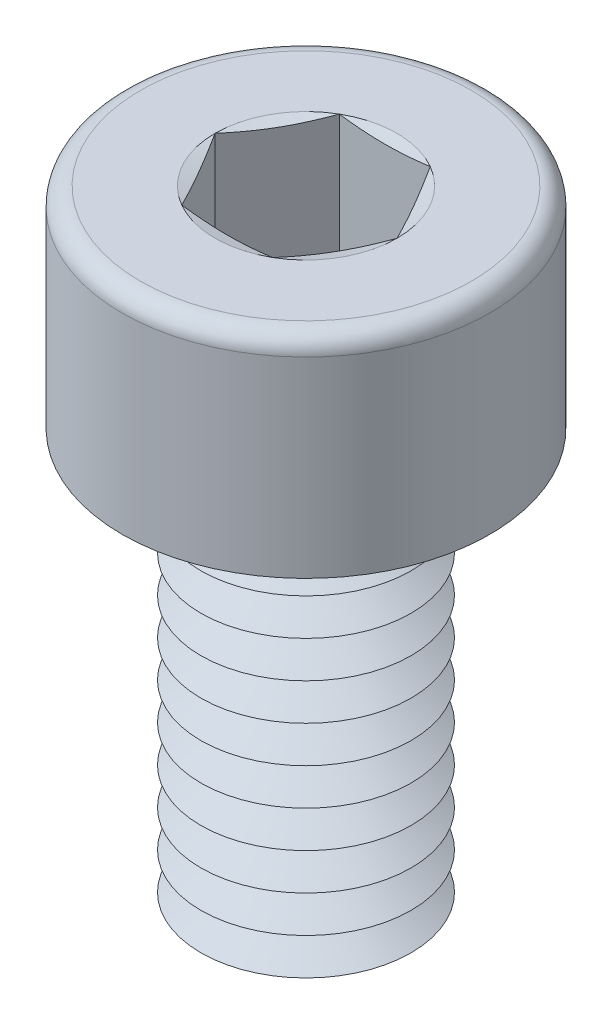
from build123d import *

# Parameters (mm, degrees)
SKETCH1_R       = 2
EXTRUDE1_DEPTH  = 8
SKETCH2_R       = 3.5
EXTRUDE2_DEPTH  = 4
EXTRUDE3_DEPTH  = 3
FILLET1_R       = 0.35
LPATTERN1_COUNT = 11
LPATTERN1_PITCH = 0.7


with BuildPart() as part:
    # Sketch1 → Extrude1 (new body)
    with BuildSketch(Plane(origin=(0, 0, 0), x_dir=(1, 0, 0), z_dir=(0, 1, 0))):
        with Locations(Location((0, 0, 0), (0, 0, 270))):
            Circle(SKETCH1_R)
    extrude(amount=EXTRUDE1_DEPTH)

    # Sketch2 → Extrude2 (add)
    with BuildSketch(Plane(origin=(0, 8, 0), x_dir=(1, 0, 0), z_dir=(0, 1, 0))):
        with Locations(Location((0, 0, 0), (0, 0, 270))):
            Circle(SKETCH2_R)
    extrude(amount=EXTRUDE2_DEPTH)

    # Sketch3 → Extrude3 (cut)
    with BuildSketch(Plane(origin=(0, 12, 0), x_dir=(1, 0, 0), z_dir=(0, 1, 0))):
        Polygon((0.866025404, 1.5), (-0.866025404, 1.5), (-1.732050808, 0), (-0.866025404, -1.5), (0.866025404, -1.5), (1.732050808, 0), align=None)
    extrude(amount=-EXTRUDE3_DEPTH, mode=Mode.SUBTRACT)

    # Fillet1
    fillet1_edges = [part.edges().sort_by_distance(p)[0] for p in [
        (0, 12, -3.5),
    ]]
    fillet(fillet1_edges, radius=FILLET1_R)

    # Sketch4 → Cut-Revolve1 (revolve, cut)
    with BuildSketch(Plane(origin=(0, 0, 0), x_dir=(0, 0, -1), z_dir=(1, 0, 0))):
        Polygon((-1.5, 9), (0, 9), (0, 8.133974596), align=None)
    revolve(axis=Axis((0, 9, 0), (0, -1, 0)), mode=Mode.SUBTRACT)

    # Sketch5 → Cut-Revolve2 (revolve, cut)
    with BuildSketch(Plane.XY, mode=Mode.PRIVATE) as cut_revolve2_sk:
        Polygon((-2, 0.35), (-2, -0.35), (-1.393782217, 0), align=None)
    cut_revolve2 = revolve(cut_revolve2_sk.sketch.rotate(Axis((0, 8, 0), (0, -1, 0)), 270), axis=Axis((0, 8, 0), (0, -1, 0)), mode=Mode.SUBTRACT)

    # LPattern1: Cut-Revolve2 ×11
    with Locations(*[(0, i * LPATTERN1_PITCH, 0) for i in range(1, LPATTERN1_COUNT)]):
        add(cut_revolve2, mode=Mode.SUBTRACT)

    # Extrude4 cone 1 section (on through the dimple's axis) → Extrude4 (revolve, cut)
    with BuildSketch(Plane(origin=(0, 12, 0), x_dir=(0, 0, 1), z_dir=(1, 0, 0))):
        Polygon((0, 0), (1.732050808, 0), (0, 0.464101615), align=None)
    revolve(axis=Axis((0, 12, 0), (0, -1, 0)), mode=Mode.SUBTRACT)


solid = part.part
